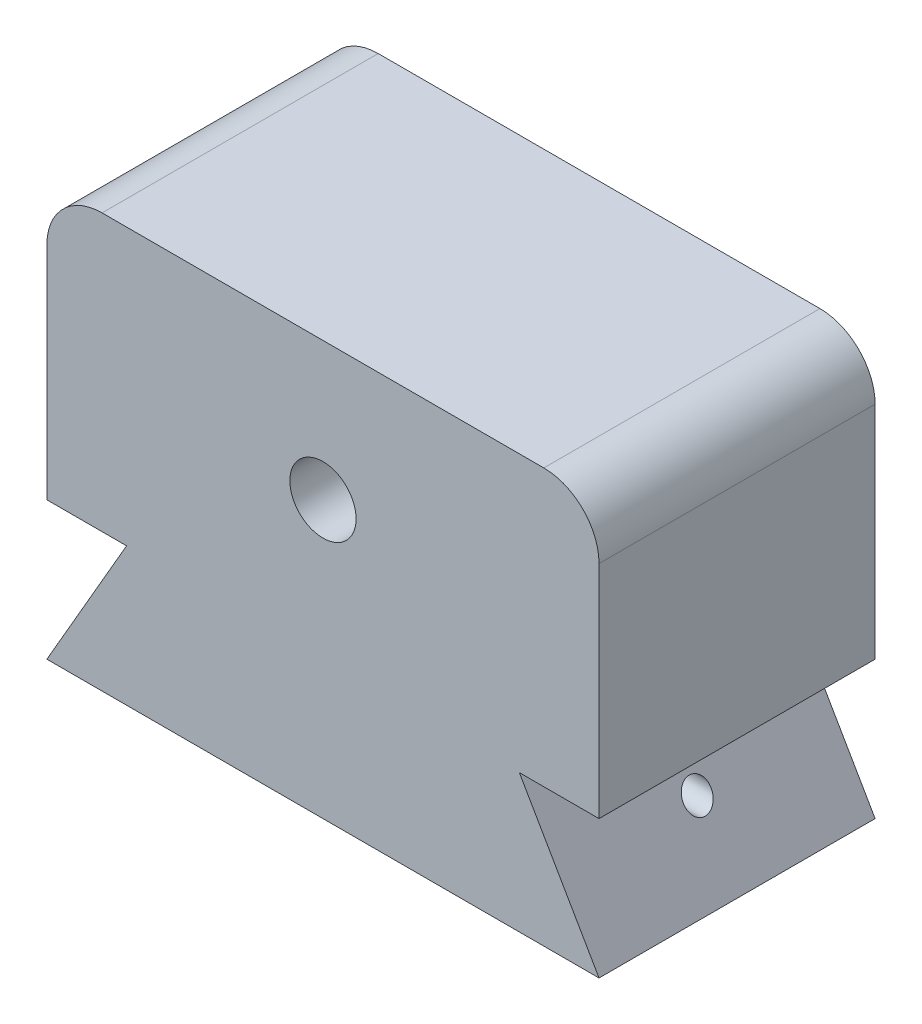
ISO-10303-21;
HEADER;
FILE_DESCRIPTION(('STEP AP214'),'2;1');
FILE_NAME('part.step','',(''),(''),'','','');
FILE_SCHEMA(('AUTOMOTIVE_DESIGN { 1 0 10303 214 1 1 1 1 }'));
ENDSEC;
DATA;
#1=APPLICATION_CONTEXT('core data for automotive mechanical design processes');
#2=APPLICATION_PROTOCOL_DEFINITION('international standard','automotive_design',2000,#1);
#3=PRODUCT_CONTEXT('',#1,'mechanical');
#4=PRODUCT('Part','Part','',(#3));
#5=PRODUCT_RELATED_PRODUCT_CATEGORY('part','',(#4));
#6=PRODUCT_DEFINITION_FORMATION('','',#4);
#7=PRODUCT_DEFINITION_CONTEXT('part definition',#1,'design');
#8=PRODUCT_DEFINITION('design','',#6,#7);
#9=PRODUCT_DEFINITION_SHAPE('','',#8);
#10=(LENGTH_UNIT() NAMED_UNIT(*) SI_UNIT(.MILLI.,.METRE.));
#11=(NAMED_UNIT(*) PLANE_ANGLE_UNIT() SI_UNIT($,.RADIAN.));
#12=(NAMED_UNIT(*) SI_UNIT($,.STERADIAN.) SOLID_ANGLE_UNIT());
#13=UNCERTAINTY_MEASURE_WITH_UNIT(LENGTH_MEASURE(1.E-05),#10,'distance_accuracy_value','');
#14=(GEOMETRIC_REPRESENTATION_CONTEXT(3) GLOBAL_UNCERTAINTY_ASSIGNED_CONTEXT((#13)) GLOBAL_UNIT_ASSIGNED_CONTEXT((#10,
#11,#12)) REPRESENTATION_CONTEXT('',''));
#15=CARTESIAN_POINT('',(0.,0.,0.));
#16=DIRECTION('',(0.,0.,1.));
#17=DIRECTION('',(1.,0.,0.));
#18=AXIS2_PLACEMENT_3D('',#15,#16,#17);
#19=CARTESIAN_POINT('',(37.4999999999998,21.6506350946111,50.));
#20=DIRECTION('',(-0.866025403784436,-0.500000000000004,0.));
#21=DIRECTION('',(0.500000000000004,-0.866025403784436,0.));
#22=AXIS2_PLACEMENT_3D('',#19,#20,#21);
#23=PLANE('',#22);
#24=CARTESIAN_POINT('',(42.7831216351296,12.5,24.9999999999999));
#25=DIRECTION('',(-0.866025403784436,-0.500000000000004,0.));
#26=DIRECTION('',(-0.500000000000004,0.866025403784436,0.));
#27=AXIS2_PLACEMENT_3D('',#24,#25,#26);
#28=ELLIPSE('',#27,2.88675134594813,2.5);
#29=CARTESIAN_POINT('',(41.3397459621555,15.,24.9999999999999));
#30=VERTEX_POINT('',#29);
#31=EDGE_CURVE('E238',#30,#30,#28,.T.);
#32=ORIENTED_EDGE('',*,*,#31,.T.);
#33=EDGE_LOOP('',(#32));
#34=FACE_BOUND('',#33,.T.);
#35=DIRECTION('',(-0.500000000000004,0.866025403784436,0.));
#36=VECTOR('',#35,1.);
#37=CARTESIAN_POINT('',(37.4999999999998,21.6506350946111,0.));
#38=LINE('',#37,#36);
#39=CARTESIAN_POINT('',(50.,0.,0.));
#40=VERTEX_POINT('',#39);
#41=CARTESIAN_POINT('',(35.5662432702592,25.,0.));
#42=VERTEX_POINT('',#41);
#43=EDGE_CURVE('E165',#40,#42,#38,.T.);
#44=ORIENTED_EDGE('',*,*,#43,.T.);
#45=DIRECTION('',(0.,0.,-1.));
#46=VECTOR('',#45,1.);
#47=CARTESIAN_POINT('',(35.5662432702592,25.,50.));
#48=LINE('',#47,#46);
#49=CARTESIAN_POINT('',(35.5662432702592,25.,50.));
#50=VERTEX_POINT('',#49);
#51=EDGE_CURVE('E11',#50,#42,#48,.T.);
#52=ORIENTED_EDGE('',*,*,#51,.F.);
#53=DIRECTION('',(-0.500000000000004,0.866025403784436,0.));
#54=VECTOR('',#53,1.);
#55=CARTESIAN_POINT('',(37.4999999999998,21.6506350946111,50.));
#56=LINE('',#55,#54);
#57=CARTESIAN_POINT('',(50.,0.,50.));
#58=VERTEX_POINT('',#57);
#59=EDGE_CURVE('E192',#58,#50,#56,.T.);
#60=ORIENTED_EDGE('',*,*,#59,.F.);
#61=DIRECTION('',(0.,0.,-1.));
#62=VECTOR('',#61,1.);
#63=CARTESIAN_POINT('',(50.,0.,50.));
#64=LINE('',#63,#62);
#65=EDGE_CURVE('E164',#58,#40,#64,.T.);
#66=ORIENTED_EDGE('',*,*,#65,.T.);
#67=EDGE_LOOP('',(#44,#52,#60,#66));
#68=FACE_BOUND('',#67,.T.);
#69=ADVANCED_FACE('F45',(#34,#68),#23,.F.);
#70=CARTESIAN_POINT('',(0.,25.,50.));
#71=DIRECTION('',(0.,1.,0.));
#72=DIRECTION('',(0.,0.,1.));
#73=AXIS2_PLACEMENT_3D('',#70,#71,#72);
#74=PLANE('',#73);
#75=DIRECTION('',(1.,0.,0.));
#76=VECTOR('',#75,1.);
#77=CARTESIAN_POINT('',(0.,25.,0.));
#78=LINE('',#77,#76);
#79=CARTESIAN_POINT('',(50.,25.,0.));
#80=VERTEX_POINT('',#79);
#81=EDGE_CURVE('E168',#42,#80,#78,.T.);
#82=ORIENTED_EDGE('',*,*,#81,.T.);
#83=DIRECTION('',(0.,0.,-1.));
#84=VECTOR('',#83,1.);
#85=CARTESIAN_POINT('',(50.,25.,50.));
#86=LINE('',#85,#84);
#87=CARTESIAN_POINT('',(50.,25.,50.));
#88=VERTEX_POINT('',#87);
#89=EDGE_CURVE('E59',#88,#80,#86,.T.);
#90=ORIENTED_EDGE('',*,*,#89,.F.);
#91=DIRECTION('',(1.,0.,0.));
#92=VECTOR('',#91,1.);
#93=CARTESIAN_POINT('',(0.,25.,50.));
#94=LINE('',#93,#92);
#95=EDGE_CURVE('E117',#50,#88,#94,.T.);
#96=ORIENTED_EDGE('',*,*,#95,.F.);
#97=ORIENTED_EDGE('',*,*,#51,.T.);
#98=EDGE_LOOP('',(#82,#90,#96,#97));
#99=FACE_BOUND('',#98,.T.);
#100=ADVANCED_FACE('F226',(#99),#74,.F.);
#101=CARTESIAN_POINT('',(50.,0.,50.));
#102=DIRECTION('',(1.,0.,0.));
#103=DIRECTION('',(0.,1.,0.));
#104=AXIS2_PLACEMENT_3D('',#101,#102,#103);
#105=PLANE('',#104);
#106=DIRECTION('',(0.,-1.,0.));
#107=VECTOR('',#106,1.);
#108=CARTESIAN_POINT('',(50.,0.,0.));
#109=LINE('',#108,#107);
#110=CARTESIAN_POINT('',(50.,65.,0.));
#111=VERTEX_POINT('',#110);
#112=EDGE_CURVE('E172',#111,#80,#109,.T.);
#113=ORIENTED_EDGE('',*,*,#112,.F.);
#114=DIRECTION('',(0.,0.,-1.));
#115=VECTOR('',#114,1.);
#116=CARTESIAN_POINT('',(50.,65.,50.));
#117=LINE('',#116,#115);
#118=CARTESIAN_POINT('',(50.,65.,50.));
#119=VERTEX_POINT('',#118);
#120=EDGE_CURVE('E202',#119,#111,#117,.T.);
#121=ORIENTED_EDGE('',*,*,#120,.F.);
#122=DIRECTION('',(0.,-1.,0.));
#123=VECTOR('',#122,1.);
#124=CARTESIAN_POINT('',(50.,0.,50.));
#125=LINE('',#124,#123);
#126=EDGE_CURVE('E250',#119,#88,#125,.T.);
#127=ORIENTED_EDGE('',*,*,#126,.T.);
#128=ORIENTED_EDGE('',*,*,#89,.T.);
#129=EDGE_LOOP('',(#113,#121,#127,#128));
#130=FACE_BOUND('',#129,.T.);
#131=ADVANCED_FACE('F233',(#130),#105,.T.);
#132=CARTESIAN_POINT('',(40.,65.,50.));
#133=DIRECTION('',(0.,0.,-1.));
#134=DIRECTION('',(-1.,0.,0.));
#135=AXIS2_PLACEMENT_3D('',#132,#133,#134);
#136=CYLINDRICAL_SURFACE('',#135,9.99999999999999);
#137=CARTESIAN_POINT('',(40.,65.,0.));
#138=DIRECTION('',(0.,0.,1.));
#139=DIRECTION('',(1.,0.,0.));
#140=AXIS2_PLACEMENT_3D('',#137,#138,#139);
#141=CIRCLE('',#140,9.99999999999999);
#142=CARTESIAN_POINT('',(39.9999999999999,75.,0.));
#143=VERTEX_POINT('',#142);
#144=EDGE_CURVE('E175',#111,#143,#141,.T.);
#145=ORIENTED_EDGE('',*,*,#144,.T.);
#146=DIRECTION('',(0.,0.,-1.));
#147=VECTOR('',#146,1.);
#148=CARTESIAN_POINT('',(39.9999999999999,75.,50.));
#149=LINE('',#148,#147);
#150=CARTESIAN_POINT('',(39.9999999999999,75.,50.));
#151=VERTEX_POINT('',#150);
#152=EDGE_CURVE('E200',#151,#143,#149,.T.);
#153=ORIENTED_EDGE('',*,*,#152,.F.);
#154=CARTESIAN_POINT('',(40.,65.,50.));
#155=DIRECTION('',(0.,0.,1.));
#156=DIRECTION('',(1.,0.,0.));
#157=AXIS2_PLACEMENT_3D('',#154,#155,#156);
#158=CIRCLE('',#157,9.99999999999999);
#159=EDGE_CURVE('E252',#119,#151,#158,.T.);
#160=ORIENTED_EDGE('',*,*,#159,.F.);
#161=ORIENTED_EDGE('',*,*,#120,.T.);
#162=EDGE_LOOP('',(#145,#153,#160,#161));
#163=FACE_BOUND('',#162,.T.);
#164=ADVANCED_FACE('F273',(#163),#136,.T.);
#165=CARTESIAN_POINT('',(0.,75.,50.));
#166=DIRECTION('',(0.,1.,0.));
#167=DIRECTION('',(0.,0.,1.));
#168=AXIS2_PLACEMENT_3D('',#165,#166,#167);
#169=PLANE('',#168);
#170=DIRECTION('',(1.,0.,0.));
#171=VECTOR('',#170,1.);
#172=CARTESIAN_POINT('',(0.,75.,0.));
#173=LINE('',#172,#171);
#174=CARTESIAN_POINT('',(-40.,75.,0.));
#175=VERTEX_POINT('',#174);
#176=EDGE_CURVE('E178',#175,#143,#173,.T.);
#177=ORIENTED_EDGE('',*,*,#176,.F.);
#178=DIRECTION('',(0.,0.,-1.));
#179=VECTOR('',#178,1.);
#180=CARTESIAN_POINT('',(-40.,75.,50.));
#181=LINE('',#180,#179);
#182=CARTESIAN_POINT('',(-40.,75.,50.));
#183=VERTEX_POINT('',#182);
#184=EDGE_CURVE('E198',#183,#175,#181,.T.);
#185=ORIENTED_EDGE('',*,*,#184,.F.);
#186=DIRECTION('',(1.,0.,0.));
#187=VECTOR('',#186,1.);
#188=CARTESIAN_POINT('',(0.,75.,50.));
#189=LINE('',#188,#187);
#190=EDGE_CURVE('E254',#183,#151,#189,.T.);
#191=ORIENTED_EDGE('',*,*,#190,.T.);
#192=ORIENTED_EDGE('',*,*,#152,.T.);
#193=EDGE_LOOP('',(#177,#185,#191,#192));
#194=FACE_BOUND('',#193,.T.);
#195=ADVANCED_FACE('F270',(#194),#169,.T.);
#196=CARTESIAN_POINT('',(-40.,65.,50.));
#197=DIRECTION('',(0.,0.,-1.));
#198=DIRECTION('',(-1.,0.,0.));
#199=AXIS2_PLACEMENT_3D('',#196,#197,#198);
#200=CYLINDRICAL_SURFACE('',#199,9.99999999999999);
#201=CARTESIAN_POINT('',(-40.,65.,0.));
#202=DIRECTION('',(0.,0.,1.));
#203=DIRECTION('',(1.,0.,0.));
#204=AXIS2_PLACEMENT_3D('',#201,#202,#203);
#205=CIRCLE('',#204,9.99999999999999);
#206=CARTESIAN_POINT('',(-50.,65.,0.));
#207=VERTEX_POINT('',#206);
#208=EDGE_CURVE('E181',#207,#175,#205,.F.);
#209=ORIENTED_EDGE('',*,*,#208,.F.);
#210=DIRECTION('',(0.,0.,-1.));
#211=VECTOR('',#210,1.);
#212=CARTESIAN_POINT('',(-50.,65.,50.));
#213=LINE('',#212,#211);
#214=CARTESIAN_POINT('',(-50.,65.,50.));
#215=VERTEX_POINT('',#214);
#216=EDGE_CURVE('E196',#215,#207,#213,.T.);
#217=ORIENTED_EDGE('',*,*,#216,.F.);
#218=CARTESIAN_POINT('',(-40.,65.,50.));
#219=DIRECTION('',(0.,0.,1.));
#220=DIRECTION('',(1.,0.,0.));
#221=AXIS2_PLACEMENT_3D('',#218,#219,#220);
#222=CIRCLE('',#221,9.99999999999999);
#223=EDGE_CURVE('E259',#215,#183,#222,.F.);
#224=ORIENTED_EDGE('',*,*,#223,.T.);
#225=ORIENTED_EDGE('',*,*,#184,.T.);
#226=EDGE_LOOP('',(#209,#217,#224,#225));
#227=FACE_BOUND('',#226,.T.);
#228=ADVANCED_FACE('F267',(#227),#200,.T.);
#229=CARTESIAN_POINT('',(-50.,0.,50.));
#230=DIRECTION('',(-1.,0.,0.));
#231=DIRECTION('',(0.,-1.,0.));
#232=AXIS2_PLACEMENT_3D('',#229,#230,#231);
#233=PLANE('',#232);
#234=DIRECTION('',(0.,1.,0.));
#235=VECTOR('',#234,1.);
#236=CARTESIAN_POINT('',(-50.,0.,0.));
#237=LINE('',#236,#235);
#238=CARTESIAN_POINT('',(-50.,25.,0.));
#239=VERTEX_POINT('',#238);
#240=EDGE_CURVE('E184',#239,#207,#237,.T.);
#241=ORIENTED_EDGE('',*,*,#240,.F.);
#242=DIRECTION('',(0.,0.,-1.));
#243=VECTOR('',#242,1.);
#244=CARTESIAN_POINT('',(-50.,25.,50.));
#245=LINE('',#244,#243);
#246=CARTESIAN_POINT('',(-50.,25.,50.));
#247=VERTEX_POINT('',#246);
#248=EDGE_CURVE('E152',#247,#239,#245,.T.);
#249=ORIENTED_EDGE('',*,*,#248,.F.);
#250=DIRECTION('',(0.,1.,0.));
#251=VECTOR('',#250,1.);
#252=CARTESIAN_POINT('',(-50.,0.,50.));
#253=LINE('',#252,#251);
#254=EDGE_CURVE('E145',#247,#215,#253,.T.);
#255=ORIENTED_EDGE('',*,*,#254,.T.);
#256=ORIENTED_EDGE('',*,*,#216,.T.);
#257=EDGE_LOOP('',(#241,#249,#255,#256));
#258=FACE_BOUND('',#257,.T.);
#259=ADVANCED_FACE('F264',(#258),#233,.T.);
#260=CARTESIAN_POINT('',(-35.5662432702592,25.,0.));
#261=VERTEX_POINT('',#260);
#262=EDGE_CURVE('E151',#239,#261,#78,.T.);
#263=ORIENTED_EDGE('',*,*,#262,.T.);
#264=DIRECTION('',(0.,0.,-1.));
#265=VECTOR('',#264,1.);
#266=CARTESIAN_POINT('',(-35.5662432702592,25.,50.));
#267=LINE('',#266,#265);
#268=CARTESIAN_POINT('',(-35.5662432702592,25.,50.));
#269=VERTEX_POINT('',#268);
#270=EDGE_CURVE('E148',#269,#261,#267,.T.);
#271=ORIENTED_EDGE('',*,*,#270,.F.);
#272=EDGE_CURVE('E137',#247,#269,#94,.T.);
#273=ORIENTED_EDGE('',*,*,#272,.F.);
#274=ORIENTED_EDGE('',*,*,#248,.T.);
#275=EDGE_LOOP('',(#263,#271,#273,#274));
#276=FACE_BOUND('',#275,.T.);
#277=ADVANCED_FACE('F149',(#276),#74,.F.);
#278=CARTESIAN_POINT('',(-37.4999999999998,21.6506350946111,50.));
#279=DIRECTION('',(0.866025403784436,-0.500000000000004,0.));
#280=DIRECTION('',(0.500000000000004,0.866025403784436,0.));
#281=AXIS2_PLACEMENT_3D('',#278,#279,#280);
#282=PLANE('',#281);
#283=CARTESIAN_POINT('',(-42.7831216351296,12.5,24.9999999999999));
#284=DIRECTION('',(0.866025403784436,-0.500000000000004,0.));
#285=DIRECTION('',(0.500000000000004,0.866025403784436,0.));
#286=AXIS2_PLACEMENT_3D('',#283,#284,#285);
#287=ELLIPSE('',#286,2.88675134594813,2.5);
#288=CARTESIAN_POINT('',(-41.3397459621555,15.,24.9999999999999));
#289=VERTEX_POINT('',#288);
#290=EDGE_CURVE('E209',#289,#289,#287,.F.);
#291=ORIENTED_EDGE('',*,*,#290,.F.);
#292=EDGE_LOOP('',(#291));
#293=FACE_BOUND('',#292,.T.);
#294=DIRECTION('',(-0.500000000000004,-0.866025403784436,0.));
#295=VECTOR('',#294,1.);
#296=CARTESIAN_POINT('',(-37.4999999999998,21.6506350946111,0.));
#297=LINE('',#296,#295);
#298=CARTESIAN_POINT('',(-50.,0.,0.));
#299=VERTEX_POINT('',#298);
#300=EDGE_CURVE('E103',#261,#299,#297,.T.);
#301=ORIENTED_EDGE('',*,*,#300,.T.);
#302=DIRECTION('',(0.,0.,-1.));
#303=VECTOR('',#302,1.);
#304=CARTESIAN_POINT('',(-50.,0.,50.));
#305=LINE('',#304,#303);
#306=CARTESIAN_POINT('',(-50.,0.,50.));
#307=VERTEX_POINT('',#306);
#308=EDGE_CURVE('E153',#307,#299,#305,.T.);
#309=ORIENTED_EDGE('',*,*,#308,.F.);
#310=DIRECTION('',(-0.500000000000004,-0.866025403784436,0.));
#311=VECTOR('',#310,1.);
#312=CARTESIAN_POINT('',(-37.4999999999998,21.6506350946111,50.));
#313=LINE('',#312,#311);
#314=EDGE_CURVE('E142',#269,#307,#313,.T.);
#315=ORIENTED_EDGE('',*,*,#314,.F.);
#316=ORIENTED_EDGE('',*,*,#270,.T.);
#317=EDGE_LOOP('',(#301,#309,#315,#316));
#318=FACE_BOUND('',#317,.T.);
#319=ADVANCED_FACE('F155',(#293,#318),#282,.F.);
#320=CARTESIAN_POINT('',(0.,0.,50.));
#321=DIRECTION('',(0.,1.,0.));
#322=DIRECTION('',(0.,0.,1.));
#323=AXIS2_PLACEMENT_3D('',#320,#321,#322);
#324=PLANE('',#323);
#325=CARTESIAN_POINT('',(0.,0.,25.));
#326=DIRECTION('',(0.,-1.,0.));
#327=DIRECTION('',(0.,0.,-1.));
#328=AXIS2_PLACEMENT_3D('',#325,#326,#327);
#329=CIRCLE('',#328,6.);
#330=CARTESIAN_POINT('',(0.,0.,19.));
#331=VERTEX_POINT('',#330);
#332=EDGE_CURVE('E309',#331,#331,#329,.T.);
#333=ORIENTED_EDGE('',*,*,#332,.F.);
#334=EDGE_LOOP('',(#333));
#335=FACE_BOUND('',#334,.T.);
#336=DIRECTION('',(1.,0.,0.));
#337=VECTOR('',#336,1.);
#338=CARTESIAN_POINT('',(0.,0.,0.));
#339=LINE('',#338,#337);
#340=EDGE_CURVE('E109',#299,#40,#339,.T.);
#341=ORIENTED_EDGE('',*,*,#340,.T.);
#342=ORIENTED_EDGE('',*,*,#65,.F.);
#343=DIRECTION('',(1.,0.,0.));
#344=VECTOR('',#343,1.);
#345=CARTESIAN_POINT('',(0.,0.,50.));
#346=LINE('',#345,#344);
#347=EDGE_CURVE('E68',#307,#58,#346,.T.);
#348=ORIENTED_EDGE('',*,*,#347,.F.);
#349=ORIENTED_EDGE('',*,*,#308,.T.);
#350=EDGE_LOOP('',(#341,#342,#348,#349));
#351=FACE_BOUND('',#350,.T.);
#352=ADVANCED_FACE('F288',(#335,#351),#324,.F.);
#353=CARTESIAN_POINT('',(0.,50.,50.));
#354=DIRECTION('',(0.,0.,-1.));
#355=DIRECTION('',(-1.,0.,0.));
#356=AXIS2_PLACEMENT_3D('',#353,#354,#355);
#357=CYLINDRICAL_SURFACE('',#356,6.);
#358=CARTESIAN_POINT('',(0.,50.,50.));
#359=DIRECTION('',(0.,0.,1.));
#360=DIRECTION('',(1.,0.,0.));
#361=AXIS2_PLACEMENT_3D('',#358,#359,#360);
#362=CIRCLE('',#361,6.);
#363=CARTESIAN_POINT('',(6.00000000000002,50.,50.));
#364=VERTEX_POINT('',#363);
#365=EDGE_CURVE('E157',#364,#364,#362,.T.);
#366=ORIENTED_EDGE('',*,*,#365,.T.);
#367=EDGE_LOOP('',(#366));
#368=FACE_BOUND('',#367,.T.);
#369=CARTESIAN_POINT('',(0.,50.,0.));
#370=DIRECTION('',(0.,0.,1.));
#371=DIRECTION('',(1.,0.,0.));
#372=AXIS2_PLACEMENT_3D('',#369,#370,#371);
#373=CIRCLE('',#372,6.);
#374=CARTESIAN_POINT('',(6.00000000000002,50.,0.));
#375=VERTEX_POINT('',#374);
#376=EDGE_CURVE('E189',#375,#375,#373,.T.);
#377=ORIENTED_EDGE('',*,*,#376,.F.);
#378=EDGE_LOOP('',(#377));
#379=FACE_BOUND('',#378,.T.);
#380=ADVANCED_FACE('F292',(#368,#379),#357,.F.);
#381=CARTESIAN_POINT('',(0.,0.,50.));
#382=DIRECTION('',(0.,0.,1.));
#383=DIRECTION('',(1.,0.,0.));
#384=AXIS2_PLACEMENT_3D('',#381,#382,#383);
#385=PLANE('',#384);
#386=ORIENTED_EDGE('',*,*,#59,.T.);
#387=ORIENTED_EDGE('',*,*,#95,.T.);
#388=ORIENTED_EDGE('',*,*,#126,.F.);
#389=ORIENTED_EDGE('',*,*,#159,.T.);
#390=ORIENTED_EDGE('',*,*,#190,.F.);
#391=ORIENTED_EDGE('',*,*,#223,.F.);
#392=ORIENTED_EDGE('',*,*,#254,.F.);
#393=ORIENTED_EDGE('',*,*,#272,.T.);
#394=ORIENTED_EDGE('',*,*,#314,.T.);
#395=ORIENTED_EDGE('',*,*,#347,.T.);
#396=EDGE_LOOP('',(#386,#387,#388,#389,#390,#391,#392,#393,#394,#395));
#397=FACE_BOUND('',#396,.T.);
#398=ORIENTED_EDGE('',*,*,#365,.F.);
#399=EDGE_LOOP('',(#398));
#400=FACE_BOUND('',#399,.T.);
#401=ADVANCED_FACE('F139',(#397,#400),#385,.T.);
#402=CARTESIAN_POINT('',(0.,0.,0.));
#403=DIRECTION('',(0.,0.,1.));
#404=DIRECTION('',(1.,0.,0.));
#405=AXIS2_PLACEMENT_3D('',#402,#403,#404);
#406=PLANE('',#405);
#407=ORIENTED_EDGE('',*,*,#43,.F.);
#408=ORIENTED_EDGE('',*,*,#340,.F.);
#409=ORIENTED_EDGE('',*,*,#300,.F.);
#410=ORIENTED_EDGE('',*,*,#262,.F.);
#411=ORIENTED_EDGE('',*,*,#240,.T.);
#412=ORIENTED_EDGE('',*,*,#208,.T.);
#413=ORIENTED_EDGE('',*,*,#176,.T.);
#414=ORIENTED_EDGE('',*,*,#144,.F.);
#415=ORIENTED_EDGE('',*,*,#112,.T.);
#416=ORIENTED_EDGE('',*,*,#81,.F.);
#417=EDGE_LOOP('',(#407,#408,#409,#410,#411,#412,#413,#414,#415,#416));
#418=FACE_BOUND('',#417,.T.);
#419=ORIENTED_EDGE('',*,*,#376,.T.);
#420=EDGE_LOOP('',(#419));
#421=FACE_BOUND('',#420,.T.);
#422=ADVANCED_FACE('F243',(#418,#421),#406,.F.);
#423=CARTESIAN_POINT('',(0.,25.,50.));
#424=DIRECTION('',(0.,1.,0.));
#425=DIRECTION('',(0.,0.,1.));
#426=AXIS2_PLACEMENT_3D('',#423,#424,#425);
#427=PLANE('',#426);
#428=CARTESIAN_POINT('',(0.,25.,25.));
#429=DIRECTION('',(0.,1.,0.));
#430=DIRECTION('',(0.,0.,1.));
#431=AXIS2_PLACEMENT_3D('',#428,#429,#430);
#432=CIRCLE('',#431,6.);
#433=CARTESIAN_POINT('',(0.,25.,31.));
#434=VERTEX_POINT('',#433);
#435=EDGE_CURVE('E169',#434,#434,#432,.F.);
#436=ORIENTED_EDGE('',*,*,#435,.T.);
#437=EDGE_LOOP('',(#436));
#438=FACE_BOUND('',#437,.T.);
#439=ADVANCED_FACE('F299',(#438),#427,.F.);
#440=CARTESIAN_POINT('',(0.,41.9705627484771,25.));
#441=DIRECTION('',(0.,-1.,0.));
#442=DIRECTION('',(0.,0.,-1.));
#443=AXIS2_PLACEMENT_3D('',#440,#441,#442);
#444=CYLINDRICAL_SURFACE('',#443,6.);
#445=CARTESIAN_POINT('',(-5.45435605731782,12.5,22.4999999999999));
#446=CARTESIAN_POINT('',(-5.45435734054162,12.4332918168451,22.5000014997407));
#447=CARTESIAN_POINT('',(-5.45558543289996,12.3665652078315,22.502675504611));
#448=CARTESIAN_POINT('',(-5.46045125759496,12.233613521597,22.513335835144));
#449=CARTESIAN_POINT('',(-5.4640904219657,12.1673887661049,22.5213253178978));
#450=CARTESIAN_POINT('',(-5.47848490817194,11.9699481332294,22.553207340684));
#451=CARTESIAN_POINT('',(-5.4927167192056,11.8401631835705,22.5850131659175));
#452=CARTESIAN_POINT('',(-5.52853615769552,11.5888452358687,22.6681999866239));
#453=CARTESIAN_POINT('',(-5.5500937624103,11.4672809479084,22.7195011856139));
#454=CARTESIAN_POINT('',(-5.59808356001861,11.234489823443,22.8399873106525));
#455=CARTESIAN_POINT('',(-5.6245145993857,11.1232605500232,22.9091680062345));
#456=CARTESIAN_POINT('',(-5.68111508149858,10.9073460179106,23.0680522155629));
#457=CARTESIAN_POINT('',(-5.71141131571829,10.8033842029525,23.1586935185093));
#458=CARTESIAN_POINT('',(-5.77128595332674,10.6116002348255,23.3559566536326));
#459=CARTESIAN_POINT('',(-5.80086407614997,10.5237843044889,23.4625846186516));
#460=CARTESIAN_POINT('',(-5.85751074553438,10.3631007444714,23.6944732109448));
#461=CARTESIAN_POINT('',(-5.8844147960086,10.2910466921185,23.820341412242));
#462=CARTESIAN_POINT('',(-5.93113040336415,10.1694480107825,24.0837359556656));
#463=CARTESIAN_POINT('',(-5.95094510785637,10.1198933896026,24.2212570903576));
#464=CARTESIAN_POINT('',(-5.98035041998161,10.0473210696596,24.4964630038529));
#465=CARTESIAN_POINT('',(-5.99041942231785,10.0230566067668,24.6337668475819));
#466=CARTESIAN_POINT('',(-6.00093657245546,9.99772472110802,24.9108416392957));
#467=CARTESIAN_POINT('',(-6.00138862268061,9.99664788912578,25.0506115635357));
#468=CARTESIAN_POINT('',(-5.99290258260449,10.0170685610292,25.3195855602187));
#469=CARTESIAN_POINT('',(-5.98453429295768,10.0371962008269,25.4489149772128));
#470=CARTESIAN_POINT('',(-5.96013033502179,10.0971062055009,25.7021657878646));
#471=CARTESIAN_POINT('',(-5.94409410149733,10.1368900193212,25.8260867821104));
#472=CARTESIAN_POINT('',(-5.90559704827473,10.2354560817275,26.0672762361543));
#473=CARTESIAN_POINT('',(-5.88304194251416,10.2945189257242,26.184414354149));
#474=CARTESIAN_POINT('',(-5.83371427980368,10.4296915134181,26.4074235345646));
#475=CARTESIAN_POINT('',(-5.8069402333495,10.5058072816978,26.5132905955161));
#476=CARTESIAN_POINT('',(-5.74963397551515,10.6791648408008,26.7186818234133));
#477=CARTESIAN_POINT('',(-5.71896988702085,10.777517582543,26.8172328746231));
#478=CARTESIAN_POINT('',(-5.65875721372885,10.9894228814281,26.9968628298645));
#479=CARTESIAN_POINT('',(-5.62920906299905,11.1029812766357,27.0779349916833));
#480=CARTESIAN_POINT('',(-5.57363224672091,11.3467900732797,27.2228037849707));
#481=CARTESIAN_POINT('',(-5.54775116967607,11.4774664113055,27.2859450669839));
#482=CARTESIAN_POINT('',(-5.50419688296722,11.7489620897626,27.3889286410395));
#483=CARTESIAN_POINT('',(-5.48651780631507,11.8897740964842,27.4287875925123));
#484=CARTESIAN_POINT('',(-5.46282425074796,12.167793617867,27.4816005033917));
#485=CARTESIAN_POINT('',(-5.45612738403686,12.3046422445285,27.4961322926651));
#486=CARTESIAN_POINT('',(-5.45320573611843,12.5789569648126,27.502512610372));
#487=CARTESIAN_POINT('',(-5.45697733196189,12.7164228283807,27.4943689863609));
#488=CARTESIAN_POINT('',(-5.47386262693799,12.9787967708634,27.4570695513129));
#489=CARTESIAN_POINT('',(-5.48636276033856,13.1039453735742,27.4292923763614));
#490=CARTESIAN_POINT('',(-5.51851260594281,13.3477025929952,27.3553411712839));
#491=CARTESIAN_POINT('',(-5.53816398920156,13.4663096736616,27.3091628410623));
#492=CARTESIAN_POINT('',(-5.58341595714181,13.6992306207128,27.1975504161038));
#493=CARTESIAN_POINT('',(-5.6092332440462,13.8131499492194,27.1313836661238));
#494=CARTESIAN_POINT('',(-5.66360007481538,14.0288161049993,26.9824015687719));
#495=CARTESIAN_POINT('',(-5.69215079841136,14.1305576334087,26.8995790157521));
#496=CARTESIAN_POINT('',(-5.75157239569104,14.3276002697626,26.7116889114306));
#497=CARTESIAN_POINT('',(-5.78244293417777,14.4217027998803,26.6053593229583));
#498=CARTESIAN_POINT('',(-5.84086722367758,14.5909445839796,26.3777030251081));
#499=CARTESIAN_POINT('',(-5.86842073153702,14.6660824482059,26.2563752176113));
#500=CARTESIAN_POINT('',(-5.9172850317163,14.7951797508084,26.0013093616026));
#501=CARTESIAN_POINT('',(-5.93857966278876,14.8490844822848,25.8675403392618));
#502=CARTESIAN_POINT('',(-5.97236346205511,14.9332335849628,25.5917176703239));
#503=CARTESIAN_POINT('',(-5.98485787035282,14.963492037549,25.4496690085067));
#504=CARTESIAN_POINT('',(-5.9990306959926,14.9977162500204,25.1720330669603));
#505=CARTESIAN_POINT('',(-6.0014040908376,15.0033719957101,25.0366881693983));
#506=CARTESIAN_POINT('',(-5.99699046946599,14.9927737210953,24.7670263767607));
#507=CARTESIAN_POINT('',(-5.99020505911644,14.976523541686,24.6327093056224));
#508=CARTESIAN_POINT('',(-5.96860132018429,14.9237878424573,24.3738270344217));
#509=CARTESIAN_POINT('',(-5.9540764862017,14.8880405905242,24.2490849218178));
#510=CARTESIAN_POINT('',(-5.91858999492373,14.7981315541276,24.0074155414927));
#511=CARTESIAN_POINT('',(-5.89762711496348,14.7439662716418,23.8904897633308));
#512=CARTESIAN_POINT('',(-5.85011651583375,14.6160207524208,23.6619508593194));
#513=CARTESIAN_POINT('',(-5.82335921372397,14.5414646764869,23.5508166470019));
#514=CARTESIAN_POINT('',(-5.76743120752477,14.3759863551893,23.3421626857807));
#515=CARTESIAN_POINT('',(-5.73825960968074,14.2850580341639,23.2446480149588));
#516=CARTESIAN_POINT('',(-5.6782970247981,14.0821074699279,23.059100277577));
#517=CARTESIAN_POINT('',(-5.64753091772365,13.96907088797,22.9721639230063));
#518=CARTESIAN_POINT('',(-5.58991059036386,13.7290936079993,22.8183339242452));
#519=CARTESIAN_POINT('',(-5.5630585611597,13.6021451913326,22.7514514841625));
#520=CARTESIAN_POINT('',(-5.516852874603,13.3380710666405,22.6403425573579));
#521=CARTESIAN_POINT('',(-5.49745949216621,13.2010040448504,22.595995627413));
#522=CARTESIAN_POINT('',(-5.4759495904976,12.9908362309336,22.5476007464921));
#523=CARTESIAN_POINT('',(-5.47004503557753,12.9200894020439,22.5344939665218));
#524=CARTESIAN_POINT('',(-5.46095373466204,12.7775739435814,22.5144186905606));
#525=CARTESIAN_POINT('',(-5.45776506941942,12.7058060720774,22.5074458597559));
#526=CARTESIAN_POINT('',(-5.45490391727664,12.589288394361,22.5011952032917));
#527=CARTESIAN_POINT('',(-5.45435519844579,12.5446483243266,22.4999989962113));
#528=CARTESIAN_POINT('',(-5.45435605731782,12.5,22.4999999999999));
#529=B_SPLINE_CURVE_WITH_KNOTS('',3,(#445,#446,#447,#448,#449,#450,#451,#452,#453,#454,#455,
#456,#457,#458,#459,#460,#461,#462,#463,#464,#465,#466,#467,#468,#469,#470,#471,#472,#473,#474,
#475,#476,#477,#478,#479,#480,#481,#482,#483,#484,#485,#486,#487,#488,#489,#490,#491,#492,#493,
#494,#495,#496,#497,#498,#499,#500,#501,#502,#503,#504,#505,#506,#507,#508,#509,#510,#511,#512,
#513,#514,#515,#516,#517,#518,#519,#520,#521,#522,#523,#524,#525,#526,#527,#528),.UNSPECIFIED.,
.T.,.F.,(4,2,2,2,2,2,2,2,2,2,2,2,2,2,2,2,2,2,2,2,2,2,2,2,2,2,2,2,2,2,2,2,2,2,2,2,2,2,2,2,2,4),
(0.,0.200084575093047,0.400288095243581,0.801278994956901,1.20064597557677,1.59991854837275,
2.02172149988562,2.44368668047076,2.88395420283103,3.32402600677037,3.74119679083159,
4.15819828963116,4.54982147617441,4.94147353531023,5.33910096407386,5.73686909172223,
6.16267530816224,6.58864548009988,7.02861558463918,7.46827048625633,7.8794002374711,
8.29038772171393,8.67506269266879,9.05982760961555,9.46088720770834,9.86212068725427,
10.2960179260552,10.7299469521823,11.1649867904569,11.5997673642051,12.004157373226,
12.4084764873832,12.7984529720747,13.1885035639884,13.5961819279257,14.004011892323,
14.4395932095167,14.8754174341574,15.3088871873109,15.5252058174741,15.7413714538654,
15.8752896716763),.UNSPECIFIED.);
#530=CARTESIAN_POINT('',(-5.45435605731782,12.5,22.4999999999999));
#531=VERTEX_POINT('',#530);
#532=EDGE_CURVE('E48',#531,#531,#529,.T.);
#533=ORIENTED_EDGE('',*,*,#532,.T.);
#534=EDGE_LOOP('',(#533));
#535=FACE_BOUND('',#534,.T.);
#536=CARTESIAN_POINT('',(5.45435605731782,12.5,22.4999999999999));
#537=CARTESIAN_POINT('',(5.45435734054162,12.5667081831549,22.5000014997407));
#538=CARTESIAN_POINT('',(5.45558543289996,12.6334347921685,22.502675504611));
#539=CARTESIAN_POINT('',(5.46045125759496,12.766386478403,22.513335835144));
#540=CARTESIAN_POINT('',(5.4640904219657,12.8326112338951,22.5213253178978));
#541=CARTESIAN_POINT('',(5.47848490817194,13.0300518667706,22.553207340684));
#542=CARTESIAN_POINT('',(5.4927167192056,13.1598368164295,22.5850131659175));
#543=CARTESIAN_POINT('',(5.52853615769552,13.4111547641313,22.6681999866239));
#544=CARTESIAN_POINT('',(5.5500937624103,13.5327190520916,22.7195011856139));
#545=CARTESIAN_POINT('',(5.59808356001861,13.765510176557,22.8399873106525));
#546=CARTESIAN_POINT('',(5.6245145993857,13.8767394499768,22.9091680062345));
#547=CARTESIAN_POINT('',(5.68111508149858,14.0926539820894,23.0680522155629));
#548=CARTESIAN_POINT('',(5.71141131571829,14.1966157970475,23.1586935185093));
#549=CARTESIAN_POINT('',(5.77128595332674,14.3883997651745,23.3559566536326));
#550=CARTESIAN_POINT('',(5.80086407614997,14.4762156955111,23.4625846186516));
#551=CARTESIAN_POINT('',(5.85751074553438,14.6368992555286,23.6944732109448));
#552=CARTESIAN_POINT('',(5.8844147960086,14.7089533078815,23.820341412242));
#553=CARTESIAN_POINT('',(5.93113040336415,14.8305519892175,24.0837359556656));
#554=CARTESIAN_POINT('',(5.95094510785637,14.8801066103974,24.2212570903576));
#555=CARTESIAN_POINT('',(5.98035041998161,14.9526789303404,24.4964630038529));
#556=CARTESIAN_POINT('',(5.99041942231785,14.9769433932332,24.6337668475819));
#557=CARTESIAN_POINT('',(6.00093657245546,15.002275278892,24.9108416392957));
#558=CARTESIAN_POINT('',(6.00138862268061,15.0033521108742,25.0506115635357));
#559=CARTESIAN_POINT('',(5.99290258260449,14.9829314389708,25.3195855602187));
#560=CARTESIAN_POINT('',(5.98453429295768,14.9628037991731,25.4489149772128));
#561=CARTESIAN_POINT('',(5.96013033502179,14.9028937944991,25.7021657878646));
#562=CARTESIAN_POINT('',(5.94409410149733,14.8631099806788,25.8260867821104));
#563=CARTESIAN_POINT('',(5.90559704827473,14.7645439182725,26.0672762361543));
#564=CARTESIAN_POINT('',(5.88304194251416,14.7054810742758,26.184414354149));
#565=CARTESIAN_POINT('',(5.83371427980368,14.5703084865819,26.4074235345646));
#566=CARTESIAN_POINT('',(5.8069402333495,14.4941927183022,26.5132905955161));
#567=CARTESIAN_POINT('',(5.74963397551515,14.3208351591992,26.7186818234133));
#568=CARTESIAN_POINT('',(5.71896988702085,14.222482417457,26.8172328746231));
#569=CARTESIAN_POINT('',(5.65875721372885,14.0105771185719,26.9968628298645));
#570=CARTESIAN_POINT('',(5.62920906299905,13.8970187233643,27.0779349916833));
#571=CARTESIAN_POINT('',(5.57363224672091,13.6532099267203,27.2228037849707));
#572=CARTESIAN_POINT('',(5.54775116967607,13.5225335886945,27.2859450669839));
#573=CARTESIAN_POINT('',(5.50419688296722,13.2510379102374,27.3889286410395));
#574=CARTESIAN_POINT('',(5.48651780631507,13.1102259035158,27.4287875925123));
#575=CARTESIAN_POINT('',(5.46282425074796,12.832206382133,27.4816005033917));
#576=CARTESIAN_POINT('',(5.45612738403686,12.6953577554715,27.4961322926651));
#577=CARTESIAN_POINT('',(5.45320573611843,12.4210430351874,27.502512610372));
#578=CARTESIAN_POINT('',(5.45697733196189,12.2835771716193,27.4943689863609));
#579=CARTESIAN_POINT('',(5.47386262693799,12.0212032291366,27.4570695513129));
#580=CARTESIAN_POINT('',(5.48636276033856,11.8960546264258,27.4292923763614));
#581=CARTESIAN_POINT('',(5.51851260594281,11.6522974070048,27.3553411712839));
#582=CARTESIAN_POINT('',(5.53816398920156,11.5336903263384,27.3091628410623));
#583=CARTESIAN_POINT('',(5.58341595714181,11.3007693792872,27.1975504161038));
#584=CARTESIAN_POINT('',(5.6092332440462,11.1868500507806,27.1313836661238));
#585=CARTESIAN_POINT('',(5.66360007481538,10.9711838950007,26.9824015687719));
#586=CARTESIAN_POINT('',(5.69215079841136,10.8694423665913,26.8995790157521));
#587=CARTESIAN_POINT('',(5.75157239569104,10.6723997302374,26.7116889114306));
#588=CARTESIAN_POINT('',(5.78244293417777,10.5782972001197,26.6053593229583));
#589=CARTESIAN_POINT('',(5.84086722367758,10.4090554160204,26.3777030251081));
#590=CARTESIAN_POINT('',(5.86842073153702,10.3339175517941,26.2563752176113));
#591=CARTESIAN_POINT('',(5.9172850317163,10.2048202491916,26.0013093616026));
#592=CARTESIAN_POINT('',(5.93857966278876,10.1509155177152,25.8675403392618));
#593=CARTESIAN_POINT('',(5.97236346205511,10.0667664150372,25.5917176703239));
#594=CARTESIAN_POINT('',(5.98485787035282,10.036507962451,25.4496690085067));
#595=CARTESIAN_POINT('',(5.9990306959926,10.0022837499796,25.1720330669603));
#596=CARTESIAN_POINT('',(6.0014040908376,9.99662800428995,25.0366881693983));
#597=CARTESIAN_POINT('',(5.99699046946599,10.0072262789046,24.7670263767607));
#598=CARTESIAN_POINT('',(5.99020505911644,10.023476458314,24.6327093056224));
#599=CARTESIAN_POINT('',(5.96860132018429,10.0762121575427,24.3738270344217));
#600=CARTESIAN_POINT('',(5.9540764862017,10.1119594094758,24.2490849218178));
#601=CARTESIAN_POINT('',(5.91858999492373,10.2018684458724,24.0074155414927));
#602=CARTESIAN_POINT('',(5.89762711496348,10.2560337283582,23.8904897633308));
#603=CARTESIAN_POINT('',(5.85011651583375,10.3839792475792,23.6619508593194));
#604=CARTESIAN_POINT('',(5.82335921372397,10.458535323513,23.5508166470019));
#605=CARTESIAN_POINT('',(5.76743120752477,10.6240136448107,23.3421626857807));
#606=CARTESIAN_POINT('',(5.73825960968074,10.7149419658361,23.2446480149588));
#607=CARTESIAN_POINT('',(5.6782970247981,10.9178925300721,23.059100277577));
#608=CARTESIAN_POINT('',(5.64753091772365,11.0309291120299,22.9721639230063));
#609=CARTESIAN_POINT('',(5.58991059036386,11.2709063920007,22.8183339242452));
#610=CARTESIAN_POINT('',(5.5630585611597,11.3978548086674,22.7514514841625));
#611=CARTESIAN_POINT('',(5.516852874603,11.6619289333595,22.6403425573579));
#612=CARTESIAN_POINT('',(5.49745949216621,11.7989959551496,22.595995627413));
#613=CARTESIAN_POINT('',(5.4759495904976,12.0091637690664,22.5476007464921));
#614=CARTESIAN_POINT('',(5.47004503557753,12.0799105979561,22.5344939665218));
#615=CARTESIAN_POINT('',(5.46095373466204,12.2224260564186,22.5144186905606));
#616=CARTESIAN_POINT('',(5.45776506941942,12.2941939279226,22.5074458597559));
#617=CARTESIAN_POINT('',(5.45490391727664,12.410711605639,22.5011952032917));
#618=CARTESIAN_POINT('',(5.45435519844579,12.4553516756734,22.4999989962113));
#619=CARTESIAN_POINT('',(5.45435605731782,12.5,22.4999999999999));
#620=B_SPLINE_CURVE_WITH_KNOTS('',3,(#536,#537,#538,#539,#540,#541,#542,#543,#544,#545,#546,
#547,#548,#549,#550,#551,#552,#553,#554,#555,#556,#557,#558,#559,#560,#561,#562,#563,#564,#565,
#566,#567,#568,#569,#570,#571,#572,#573,#574,#575,#576,#577,#578,#579,#580,#581,#582,#583,#584,
#585,#586,#587,#588,#589,#590,#591,#592,#593,#594,#595,#596,#597,#598,#599,#600,#601,#602,#603,
#604,#605,#606,#607,#608,#609,#610,#611,#612,#613,#614,#615,#616,#617,#618,#619),.UNSPECIFIED.,
.T.,.F.,(4,2,2,2,2,2,2,2,2,2,2,2,2,2,2,2,2,2,2,2,2,2,2,2,2,2,2,2,2,2,2,2,2,2,2,2,2,2,2,2,2,4),
(0.,0.200084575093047,0.400288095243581,0.801278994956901,1.20064597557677,1.59991854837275,
2.02172149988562,2.44368668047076,2.88395420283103,3.32402600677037,3.74119679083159,
4.15819828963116,4.54982147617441,4.94147353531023,5.33910096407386,5.73686909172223,
6.16267530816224,6.58864548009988,7.02861558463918,7.46827048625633,7.8794002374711,
8.29038772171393,8.67506269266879,9.05982760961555,9.46088720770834,9.86212068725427,
10.2960179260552,10.7299469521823,11.1649867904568,11.5997673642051,12.004157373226,
12.4084764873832,12.7984529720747,13.1885035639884,13.5961819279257,14.004011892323,
14.4395932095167,14.8754174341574,15.3088871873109,15.5252058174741,15.7413714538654,
15.8752896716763),.UNSPECIFIED.);
#621=CARTESIAN_POINT('',(5.45435605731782,12.5,22.4999999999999));
#622=VERTEX_POINT('',#621);
#623=EDGE_CURVE('E204',#622,#622,#620,.T.);
#624=ORIENTED_EDGE('',*,*,#623,.T.);
#625=EDGE_LOOP('',(#624));
#626=FACE_BOUND('',#625,.T.);
#627=ORIENTED_EDGE('',*,*,#332,.T.);
#628=EDGE_LOOP('',(#627));
#629=FACE_BOUND('',#628,.T.);
#630=ORIENTED_EDGE('',*,*,#435,.F.);
#631=EDGE_LOOP('',(#630));
#632=FACE_BOUND('',#631,.T.);
#633=ADVANCED_FACE('F210',(#535,#626,#629,#632),#444,.F.);
#634=CARTESIAN_POINT('',(-50.401138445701,12.5,24.9999999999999));
#635=DIRECTION('',(1.,0.,0.));
#636=DIRECTION('',(0.,0.,-1.));
#637=AXIS2_PLACEMENT_3D('',#634,#635,#636);
#638=CYLINDRICAL_SURFACE('',#637,2.5);
#639=ORIENTED_EDGE('',*,*,#31,.F.);
#640=EDGE_LOOP('',(#639));
#641=FACE_BOUND('',#640,.T.);
#642=ORIENTED_EDGE('',*,*,#623,.F.);
#643=EDGE_LOOP('',(#642));
#644=FACE_BOUND('',#643,.T.);
#645=ADVANCED_FACE('F216',(#641,#644),#638,.F.);
#646=ORIENTED_EDGE('',*,*,#290,.T.);
#647=EDGE_LOOP('',(#646));
#648=FACE_BOUND('',#647,.T.);
#649=ORIENTED_EDGE('',*,*,#532,.F.);
#650=EDGE_LOOP('',(#649));
#651=FACE_BOUND('',#650,.T.);
#652=ADVANCED_FACE('F213',(#648,#651),#638,.F.);
#653=CLOSED_SHELL('',(#69,#100,#131,#164,#195,#228,#259,#277,#319,#352,#380,#401,#422,#439,#633,
#645,#652));
#654=MANIFOLD_SOLID_BREP('B2',#653);
#655=ADVANCED_BREP_SHAPE_REPRESENTATION('',(#18,#654),#14);
#656=SHAPE_DEFINITION_REPRESENTATION(#9,#655);
ENDSEC;
END-ISO-10303-21;
